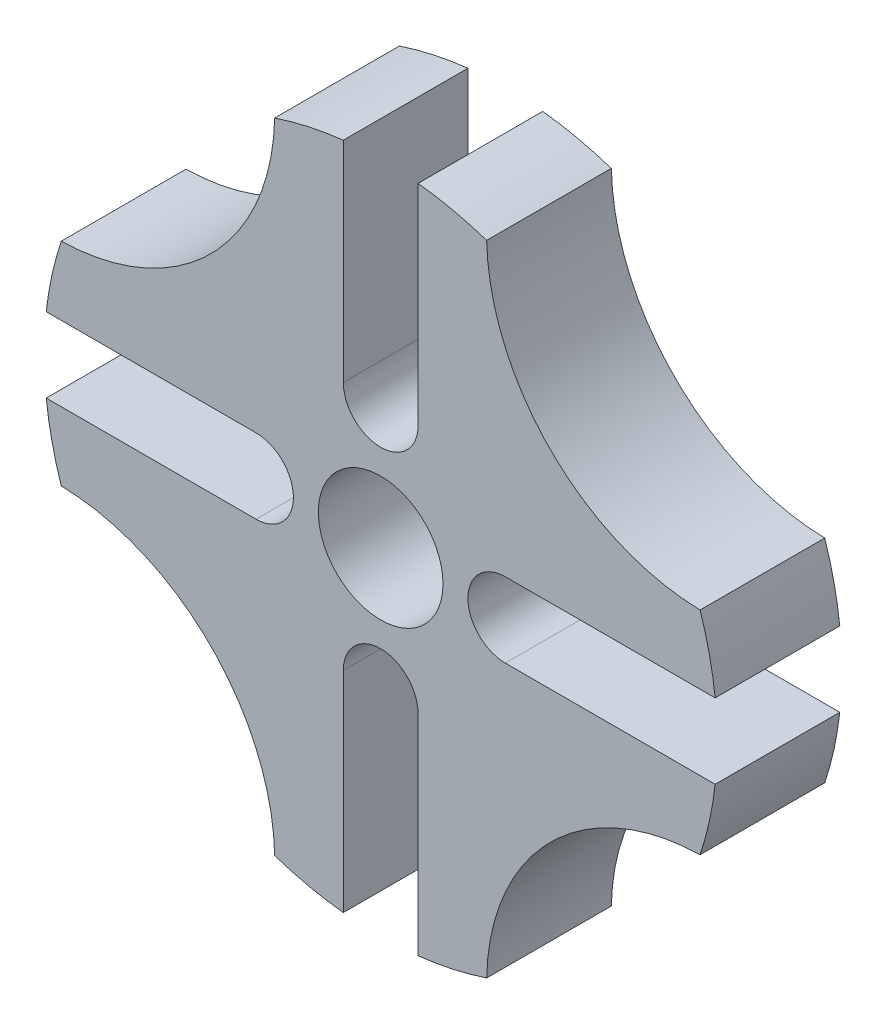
from build123d import *

# Parameters (mm, degrees)
ESQUISSE1_R                  = 27
ESQUISSE1_R_2                = 5
EXTRUSION1_DEPTH             = 10
ENL_V_MAT_EXTRU_1_DEPTH      = 40.471508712
R_P_TITION_CIRCULAIRE1_COUNT = 4
ENL_V_MAT_EXTRU_2_DEPTH      = 40.242833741
R_P_TITION_CIRCULAIRE2_COUNT = 4


with BuildPart() as part:
    # Esquisse1 → Extrusion1 (new body)
    with BuildSketch(Plane.XY):
        Circle(ESQUISSE1_R)
        Circle(ESQUISSE1_R_2, mode=Mode.SUBTRACT)
    extrude(amount=EXTRUSION1_DEPTH)

    # Esquisse2 → Enl_v. mat.-Extru.1 (cut, through all)
    with BuildSketch(Plane.XY.offset(10)):
        with BuildLine():
            Line((10, 3), (26.83281573, 3))
            ThreePointArc((26.83281573, 3), (27, 0), (26.83281573, -3))
            Line((26.83281573, -3), (10, -3))
            ThreePointArc((10, -3), (7, 0), (10, 3))
        make_face()
    enl_v_mat_extru_1 = extrude(amount=-ENL_V_MAT_EXTRU_1_DEPTH, mode=Mode.SUBTRACT)

    # R_p_tition circulaire1: Enl_v. mat.-Extru.1 ×4 about axis
    r_p_tition_circulaire1_axis = Axis((0, 0, 0), (0, 0, 1))
    for i in range(1, R_P_TITION_CIRCULAIRE1_COUNT):
        add(enl_v_mat_extru_1.rotate(r_p_tition_circulaire1_axis, i * 360 / R_P_TITION_CIRCULAIRE1_COUNT), mode=Mode.SUBTRACT)

    # Esquisse3 → Enl_v. mat.-Extru.2 (cut, through all)
    with BuildSketch(Plane.XY.offset(10)):
        with BuildLine():
            ThreePointArc((8.504001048, 25.625806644), (13.625631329, 13.625631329), (25.625806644, 8.504001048))
            ThreePointArc((25.625806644, 8.504001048), (19.091883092, 19.091883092), (8.504001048, 25.625806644))
        make_face()
    enl_v_mat_extru_2 = extrude(amount=-ENL_V_MAT_EXTRU_2_DEPTH, mode=Mode.SUBTRACT)

    # R_p_tition circulaire2: Enl_v. mat.-Extru.2 ×4 about axis
    r_p_tition_circulaire2_axis = Axis((0, 0, 0), (0, 0, 1))
    for i in range(1, R_P_TITION_CIRCULAIRE2_COUNT):
        add(enl_v_mat_extru_2.rotate(r_p_tition_circulaire2_axis, i * 360 / R_P_TITION_CIRCULAIRE2_COUNT), mode=Mode.SUBTRACT)


solid = part.part
